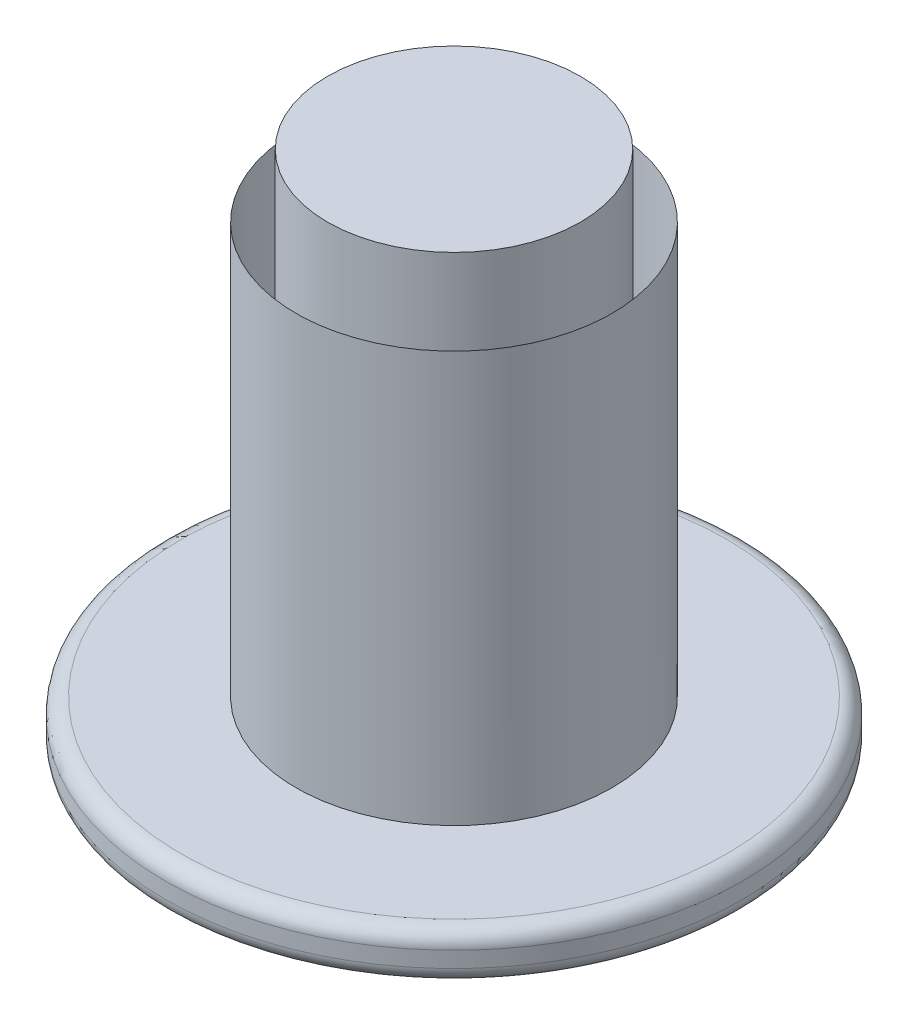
ISO-10303-21;
HEADER;
FILE_DESCRIPTION(('STEP AP214'),'2;1');
FILE_NAME('part.step','',(''),(''),'','','');
FILE_SCHEMA(('AUTOMOTIVE_DESIGN { 1 0 10303 214 1 1 1 1 }'));
ENDSEC;
DATA;
#1=APPLICATION_CONTEXT('core data for automotive mechanical design processes');
#2=APPLICATION_PROTOCOL_DEFINITION('international standard','automotive_design',2000,#1);
#3=PRODUCT_CONTEXT('',#1,'mechanical');
#4=PRODUCT('Part','Part','',(#3));
#5=PRODUCT_RELATED_PRODUCT_CATEGORY('part','',(#4));
#6=PRODUCT_DEFINITION_FORMATION('','',#4);
#7=PRODUCT_DEFINITION_CONTEXT('part definition',#1,'design');
#8=PRODUCT_DEFINITION('design','',#6,#7);
#9=PRODUCT_DEFINITION_SHAPE('','',#8);
#10=(LENGTH_UNIT() NAMED_UNIT(*) SI_UNIT(.MILLI.,.METRE.));
#11=(NAMED_UNIT(*) PLANE_ANGLE_UNIT() SI_UNIT($,.RADIAN.));
#12=(NAMED_UNIT(*) SI_UNIT($,.STERADIAN.) SOLID_ANGLE_UNIT());
#13=UNCERTAINTY_MEASURE_WITH_UNIT(LENGTH_MEASURE(1.E-05),#10,'distance_accuracy_value','');
#14=(GEOMETRIC_REPRESENTATION_CONTEXT(3) GLOBAL_UNCERTAINTY_ASSIGNED_CONTEXT((#13)) GLOBAL_UNIT_ASSIGNED_CONTEXT((#10,
#11,#12)) REPRESENTATION_CONTEXT('',''));
#15=CARTESIAN_POINT('',(0.,0.,0.));
#16=DIRECTION('',(0.,0.,1.));
#17=DIRECTION('',(1.,0.,0.));
#18=AXIS2_PLACEMENT_3D('',#15,#16,#17);
#19=CARTESIAN_POINT('',(0.,0.3,0.));
#20=DIRECTION('',(0.,1.,0.));
#21=DIRECTION('',(-1.,0.,0.));
#22=AXIS2_PLACEMENT_3D('',#19,#20,#21);
#23=CYLINDRICAL_SURFACE('',#22,1.);
#24=CARTESIAN_POINT('',(0.,2.9,0.));
#25=DIRECTION('',(0.,-1.,0.));
#26=DIRECTION('',(0.,0.,-1.));
#27=AXIS2_PLACEMENT_3D('',#24,#25,#26);
#28=CIRCLE('',#27,1.);
#29=CARTESIAN_POINT('',(0.,2.9,-1.));
#30=VERTEX_POINT('',#29);
#31=EDGE_CURVE('E44',#30,#30,#28,.F.);
#32=ORIENTED_EDGE('',*,*,#31,.F.);
#33=EDGE_LOOP('',(#32));
#34=FACE_BOUND('',#33,.T.);
#35=CARTESIAN_POINT('',(0.,0.3,0.));
#36=DIRECTION('',(0.,1.,0.));
#37=DIRECTION('',(-1.,0.,0.));
#38=AXIS2_PLACEMENT_3D('',#35,#36,#37);
#39=CIRCLE('',#38,1.);
#40=CARTESIAN_POINT('',(-1.,0.3,0.));
#41=VERTEX_POINT('',#40);
#42=EDGE_CURVE('E11',#41,#41,#39,.T.);
#43=ORIENTED_EDGE('',*,*,#42,.T.);
#44=EDGE_LOOP('',(#43));
#45=FACE_BOUND('',#44,.T.);
#46=ADVANCED_FACE('F43',(#34,#45),#23,.T.);
#47=OPEN_SHELL('',(#46));
#48=SHELL_BASED_SURFACE_MODEL('B2',(#47));
#49=CARTESIAN_POINT('',(0.,0.,0.));
#50=DIRECTION('',(0.,1.,0.));
#51=DIRECTION('',(0.,0.,1.));
#52=AXIS2_PLACEMENT_3D('',#49,#50,#51);
#53=PLANE('',#52);
#54=CARTESIAN_POINT('',(0.,0.,0.));
#55=DIRECTION('',(0.,1.,0.));
#56=DIRECTION('',(0.,0.,1.));
#57=AXIS2_PLACEMENT_3D('',#54,#55,#56);
#58=CIRCLE('',#57,1.725);
#59=CARTESIAN_POINT('',(0.,0.,1.725));
#60=VERTEX_POINT('',#59);
#61=EDGE_CURVE('E42',#60,#60,#58,.F.);
#62=ORIENTED_EDGE('',*,*,#61,.T.);
#63=EDGE_LOOP('',(#62));
#64=FACE_BOUND('',#63,.T.);
#65=ADVANCED_FACE('F68',(#64),#53,.F.);
#66=CARTESIAN_POINT('',(0.,3.3,0.));
#67=DIRECTION('',(0.,1.,0.));
#68=DIRECTION('',(0.,0.,1.));
#69=AXIS2_PLACEMENT_3D('',#66,#67,#68);
#70=CYLINDRICAL_SURFACE('',#69,1.825);
#71=CARTESIAN_POINT('',(0.,0.2,0.));
#72=DIRECTION('',(0.,-1.,0.));
#73=DIRECTION('',(0.,0.,-1.));
#74=AXIS2_PLACEMENT_3D('',#71,#72,#73);
#75=CIRCLE('',#74,1.825);
#76=CARTESIAN_POINT('',(0.,0.2,-1.825));
#77=VERTEX_POINT('',#76);
#78=EDGE_CURVE('E75',#77,#77,#75,.T.);
#79=ORIENTED_EDGE('',*,*,#78,.T.);
#80=EDGE_LOOP('',(#79));
#81=FACE_BOUND('',#80,.T.);
#82=CARTESIAN_POINT('',(0.,0.0999999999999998,0.));
#83=DIRECTION('',(0.,1.,0.));
#84=DIRECTION('',(0.,0.,1.));
#85=AXIS2_PLACEMENT_3D('',#82,#83,#84);
#86=CIRCLE('',#85,1.825);
#87=CARTESIAN_POINT('',(0.,0.0999999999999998,1.825));
#88=VERTEX_POINT('',#87);
#89=EDGE_CURVE('E79',#88,#88,#86,.T.);
#90=ORIENTED_EDGE('',*,*,#89,.T.);
#91=EDGE_LOOP('',(#90));
#92=FACE_BOUND('',#91,.T.);
#93=ADVANCED_FACE('F105',(#81,#92),#70,.T.);
#94=CARTESIAN_POINT('',(1.825,0.3,0.));
#95=DIRECTION('',(0.,-1.,0.));
#96=DIRECTION('',(0.,0.,-1.));
#97=AXIS2_PLACEMENT_3D('',#94,#95,#96);
#98=PLANE('',#97);
#99=CARTESIAN_POINT('',(0.,0.3,0.));
#100=DIRECTION('',(0.,-1.,0.));
#101=DIRECTION('',(0.,0.,-1.));
#102=AXIS2_PLACEMENT_3D('',#99,#100,#101);
#103=CIRCLE('',#102,1.725);
#104=CARTESIAN_POINT('',(0.,0.3,-1.725));
#105=VERTEX_POINT('',#104);
#106=EDGE_CURVE('E83',#105,#105,#103,.F.);
#107=ORIENTED_EDGE('',*,*,#106,.T.);
#108=EDGE_LOOP('',(#107));
#109=FACE_BOUND('',#108,.T.);
#110=CARTESIAN_POINT('',(0.,0.3,0.));
#111=DIRECTION('',(0.,1.,0.));
#112=DIRECTION('',(0.,0.,1.));
#113=AXIS2_PLACEMENT_3D('',#110,#111,#112);
#114=CIRCLE('',#113,0.8);
#115=CARTESIAN_POINT('',(0.,0.3,0.8));
#116=VERTEX_POINT('',#115);
#117=EDGE_CURVE('E88',#116,#116,#114,.T.);
#118=ORIENTED_EDGE('',*,*,#117,.F.);
#119=EDGE_LOOP('',(#118));
#120=FACE_BOUND('',#119,.T.);
#121=ADVANCED_FACE('F100',(#109,#120),#98,.F.);
#122=CARTESIAN_POINT('',(0.,3.3,0.));
#123=DIRECTION('',(0.,1.,0.));
#124=DIRECTION('',(0.,0.,1.));
#125=AXIS2_PLACEMENT_3D('',#122,#123,#124);
#126=CYLINDRICAL_SURFACE('',#125,0.8);
#127=CARTESIAN_POINT('',(0.,3.3,0.));
#128=DIRECTION('',(0.,1.,0.));
#129=DIRECTION('',(0.,0.,1.));
#130=AXIS2_PLACEMENT_3D('',#127,#128,#129);
#131=CIRCLE('',#130,0.8);
#132=CARTESIAN_POINT('',(0.,3.3,0.8));
#133=VERTEX_POINT('',#132);
#134=EDGE_CURVE('E91',#133,#133,#131,.T.);
#135=ORIENTED_EDGE('',*,*,#134,.F.);
#136=EDGE_LOOP('',(#135));
#137=FACE_BOUND('',#136,.T.);
#138=ORIENTED_EDGE('',*,*,#117,.T.);
#139=EDGE_LOOP('',(#138));
#140=FACE_BOUND('',#139,.T.);
#141=ADVANCED_FACE('F97',(#137,#140),#126,.T.);
#142=CARTESIAN_POINT('',(0.8,3.3,0.));
#143=DIRECTION('',(0.,-1.,0.));
#144=DIRECTION('',(0.,0.,-1.));
#145=AXIS2_PLACEMENT_3D('',#142,#143,#144);
#146=PLANE('',#145);
#147=ORIENTED_EDGE('',*,*,#134,.T.);
#148=EDGE_LOOP('',(#147));
#149=FACE_BOUND('',#148,.T.);
#150=ADVANCED_FACE('F95',(#149),#146,.F.);
#151=CARTESIAN_POINT('',(0.,0.2,0.));
#152=DIRECTION('',(0.,-1.,0.));
#153=DIRECTION('',(0.,0.,-1.));
#154=AXIS2_PLACEMENT_3D('',#151,#152,#153);
#155=TOROIDAL_SURFACE('',#154,1.725,0.1);
#156=ORIENTED_EDGE('',*,*,#78,.F.);
#157=EDGE_LOOP('',(#156));
#158=FACE_BOUND('',#157,.T.);
#159=ORIENTED_EDGE('',*,*,#106,.F.);
#160=EDGE_LOOP('',(#159));
#161=FACE_BOUND('',#160,.T.);
#162=ADVANCED_FACE('F116',(#158,#161),#155,.T.);
#163=CARTESIAN_POINT('',(0.,0.0999999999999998,0.));
#164=DIRECTION('',(0.,1.,0.));
#165=DIRECTION('',(0.,0.,1.));
#166=AXIS2_PLACEMENT_3D('',#163,#164,#165);
#167=TOROIDAL_SURFACE('',#166,1.725,0.1);
#168=ORIENTED_EDGE('',*,*,#61,.F.);
#169=EDGE_LOOP('',(#168));
#170=FACE_BOUND('',#169,.T.);
#171=ORIENTED_EDGE('',*,*,#89,.F.);
#172=EDGE_LOOP('',(#171));
#173=FACE_BOUND('',#172,.T.);
#174=ADVANCED_FACE('F70',(#170,#173),#167,.T.);
#175=CLOSED_SHELL('',(#65,#93,#121,#141,#150,#162,#174));
#176=MANIFOLD_SOLID_BREP('B6',#175);
#177=ADVANCED_BREP_SHAPE_REPRESENTATION('',(#18,#176),#14);
#178=MANIFOLD_SURFACE_SHAPE_REPRESENTATION('',(#18,#48),#14);
#179=SHAPE_REPRESENTATION('',(#18),#14);
#180=SHAPE_DEFINITION_REPRESENTATION(#9,#179);
#181=SHAPE_REPRESENTATION_RELATIONSHIP('','',#179,#177);
#182=SHAPE_REPRESENTATION_RELATIONSHIP('','',#179,#178);
ENDSEC;
END-ISO-10303-21;
